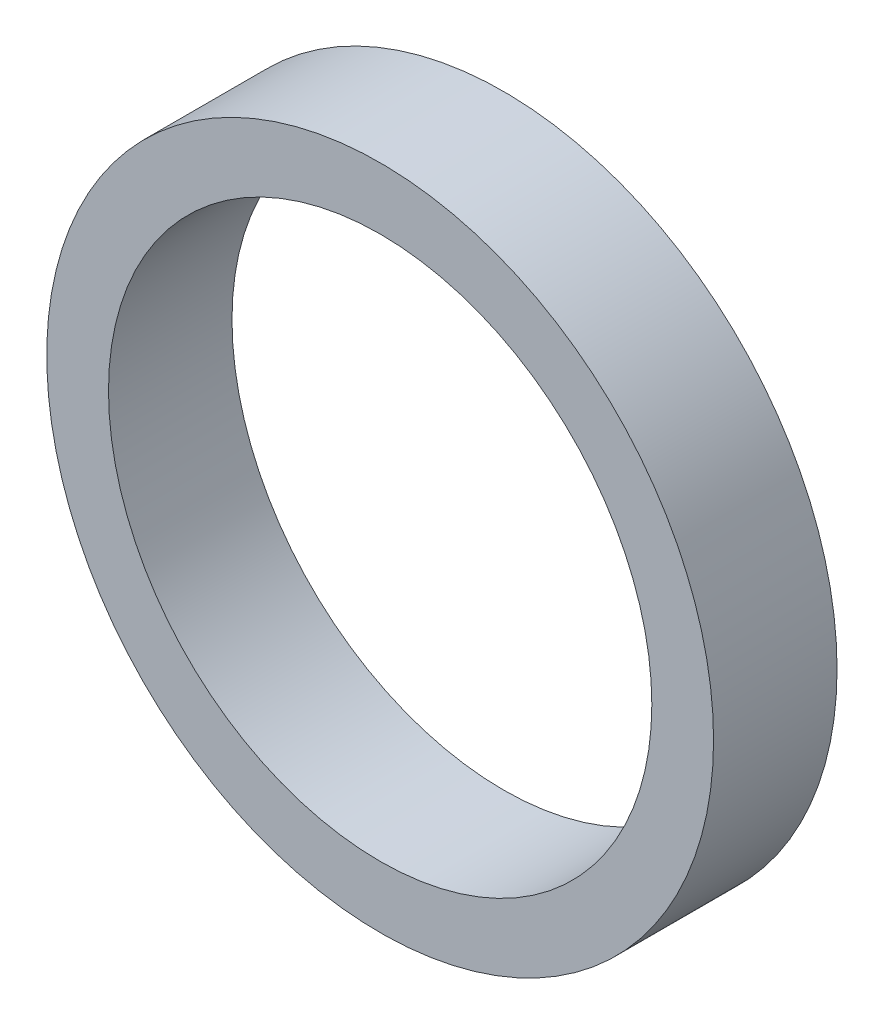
ISO-10303-21;
HEADER;
FILE_DESCRIPTION(('STEP AP214'),'2;1');
FILE_NAME('part.step','',(''),(''),'','','');
FILE_SCHEMA(('AUTOMOTIVE_DESIGN { 1 0 10303 214 1 1 1 1 }'));
ENDSEC;
DATA;
#1=APPLICATION_CONTEXT('core data for automotive mechanical design processes');
#2=APPLICATION_PROTOCOL_DEFINITION('international standard','automotive_design',2000,#1);
#3=PRODUCT_CONTEXT('',#1,'mechanical');
#4=PRODUCT('Part','Part','',(#3));
#5=PRODUCT_RELATED_PRODUCT_CATEGORY('part','',(#4));
#6=PRODUCT_DEFINITION_FORMATION('','',#4);
#7=PRODUCT_DEFINITION_CONTEXT('part definition',#1,'design');
#8=PRODUCT_DEFINITION('design','',#6,#7);
#9=PRODUCT_DEFINITION_SHAPE('','',#8);
#10=(LENGTH_UNIT() NAMED_UNIT(*) SI_UNIT(.MILLI.,.METRE.));
#11=(NAMED_UNIT(*) PLANE_ANGLE_UNIT() SI_UNIT($,.RADIAN.));
#12=(NAMED_UNIT(*) SI_UNIT($,.STERADIAN.) SOLID_ANGLE_UNIT());
#13=UNCERTAINTY_MEASURE_WITH_UNIT(LENGTH_MEASURE(1.E-05),#10,'distance_accuracy_value','');
#14=(GEOMETRIC_REPRESENTATION_CONTEXT(3) GLOBAL_UNCERTAINTY_ASSIGNED_CONTEXT((#13)) GLOBAL_UNIT_ASSIGNED_CONTEXT((#10,
#11,#12)) REPRESENTATION_CONTEXT('',''));
#15=CARTESIAN_POINT('',(0.,0.,0.));
#16=DIRECTION('',(0.,0.,1.));
#17=DIRECTION('',(1.,0.,0.));
#18=AXIS2_PLACEMENT_3D('',#15,#16,#17);
#19=CARTESIAN_POINT('',(0.,0.,5.));
#20=DIRECTION('',(0.,0.,1.));
#21=DIRECTION('',(1.,0.,0.));
#22=AXIS2_PLACEMENT_3D('',#19,#20,#21);
#23=PLANE('',#22);
#24=CARTESIAN_POINT('',(0.,0.,5.));
#25=DIRECTION('',(0.,0.,1.));
#26=DIRECTION('',(1.,0.,0.));
#27=AXIS2_PLACEMENT_3D('',#24,#25,#26);
#28=CIRCLE('',#27,13.5);
#29=CARTESIAN_POINT('',(13.5,0.,5.));
#30=VERTEX_POINT('',#29);
#31=EDGE_CURVE('E10',#30,#30,#28,.T.);
#32=ORIENTED_EDGE('',*,*,#31,.T.);
#33=EDGE_LOOP('',(#32));
#34=FACE_BOUND('',#33,.T.);
#35=CARTESIAN_POINT('',(0.,0.,5.));
#36=DIRECTION('',(0.,0.,1.));
#37=DIRECTION('',(1.,0.,0.));
#38=AXIS2_PLACEMENT_3D('',#35,#36,#37);
#39=CIRCLE('',#38,11.);
#40=CARTESIAN_POINT('',(11.,0.,5.));
#41=VERTEX_POINT('',#40);
#42=EDGE_CURVE('E33',#41,#41,#39,.T.);
#43=ORIENTED_EDGE('',*,*,#42,.F.);
#44=EDGE_LOOP('',(#43));
#45=FACE_BOUND('',#44,.T.);
#46=ADVANCED_FACE('F22',(#34,#45),#23,.T.);
#47=CARTESIAN_POINT('',(0.,0.,0.));
#48=DIRECTION('',(0.,0.,1.));
#49=DIRECTION('',(1.,0.,0.));
#50=AXIS2_PLACEMENT_3D('',#47,#48,#49);
#51=PLANE('',#50);
#52=CARTESIAN_POINT('',(0.,0.,0.));
#53=DIRECTION('',(0.,0.,1.));
#54=DIRECTION('',(1.,0.,0.));
#55=AXIS2_PLACEMENT_3D('',#52,#53,#54);
#56=CIRCLE('',#55,13.5);
#57=CARTESIAN_POINT('',(13.5,0.,0.));
#58=VERTEX_POINT('',#57);
#59=EDGE_CURVE('E29',#58,#58,#56,.T.);
#60=ORIENTED_EDGE('',*,*,#59,.F.);
#61=EDGE_LOOP('',(#60));
#62=FACE_BOUND('',#61,.T.);
#63=CARTESIAN_POINT('',(0.,0.,0.));
#64=DIRECTION('',(0.,0.,1.));
#65=DIRECTION('',(1.,0.,0.));
#66=AXIS2_PLACEMENT_3D('',#63,#64,#65);
#67=CIRCLE('',#66,11.);
#68=CARTESIAN_POINT('',(11.,0.,0.));
#69=VERTEX_POINT('',#68);
#70=EDGE_CURVE('E37',#69,#69,#67,.T.);
#71=ORIENTED_EDGE('',*,*,#70,.T.);
#72=EDGE_LOOP('',(#71));
#73=FACE_BOUND('',#72,.T.);
#74=ADVANCED_FACE('F43',(#62,#73),#51,.F.);
#75=CARTESIAN_POINT('',(0.,0.,5.));
#76=DIRECTION('',(0.,0.,-1.));
#77=DIRECTION('',(-1.,0.,0.));
#78=AXIS2_PLACEMENT_3D('',#75,#76,#77);
#79=CYLINDRICAL_SURFACE('',#78,13.5);
#80=ORIENTED_EDGE('',*,*,#31,.F.);
#81=EDGE_LOOP('',(#80));
#82=FACE_BOUND('',#81,.T.);
#83=ORIENTED_EDGE('',*,*,#59,.T.);
#84=EDGE_LOOP('',(#83));
#85=FACE_BOUND('',#84,.T.);
#86=ADVANCED_FACE('F24',(#82,#85),#79,.T.);
#87=CARTESIAN_POINT('',(0.,0.,5.));
#88=DIRECTION('',(0.,0.,-1.));
#89=DIRECTION('',(-1.,0.,0.));
#90=AXIS2_PLACEMENT_3D('',#87,#88,#89);
#91=CYLINDRICAL_SURFACE('',#90,11.);
#92=ORIENTED_EDGE('',*,*,#42,.T.);
#93=EDGE_LOOP('',(#92));
#94=FACE_BOUND('',#93,.T.);
#95=ORIENTED_EDGE('',*,*,#70,.F.);
#96=EDGE_LOOP('',(#95));
#97=FACE_BOUND('',#96,.T.);
#98=ADVANCED_FACE('F45',(#94,#97),#91,.F.);
#99=CLOSED_SHELL('',(#46,#74,#86,#98));
#100=MANIFOLD_SOLID_BREP('B2',#99);
#101=ADVANCED_BREP_SHAPE_REPRESENTATION('',(#18,#100),#14);
#102=SHAPE_DEFINITION_REPRESENTATION(#9,#101);
ENDSEC;
END-ISO-10303-21;
